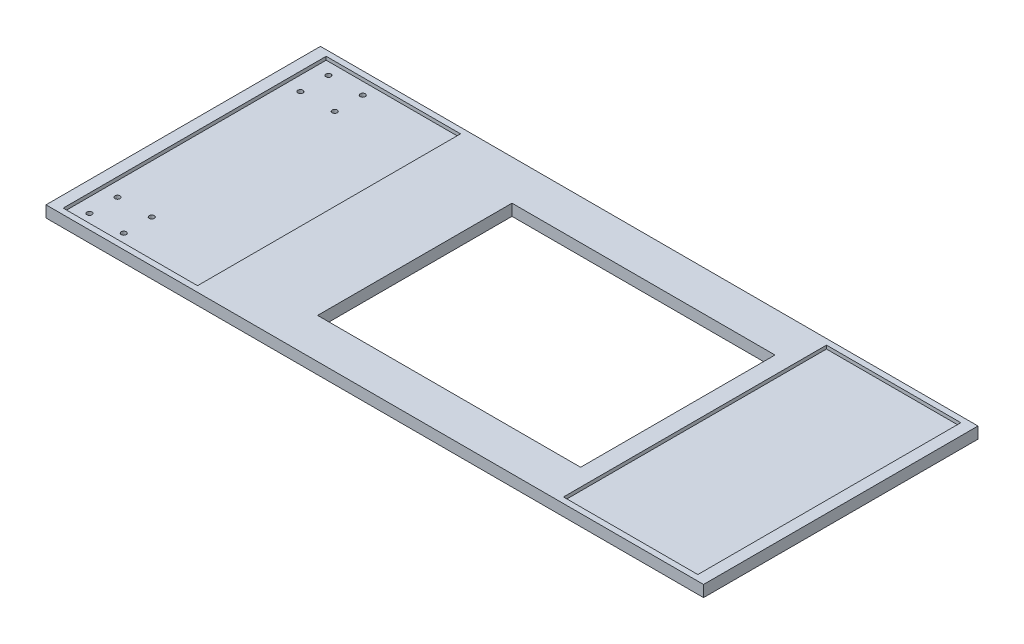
ISO-10303-21;
HEADER;
FILE_DESCRIPTION(('STEP AP214'),'2;1');
FILE_NAME('part.step','',(''),(''),'','','');
FILE_SCHEMA(('AUTOMOTIVE_DESIGN { 1 0 10303 214 1 1 1 1 }'));
ENDSEC;
DATA;
#1=APPLICATION_CONTEXT('core data for automotive mechanical design processes');
#2=APPLICATION_PROTOCOL_DEFINITION('international standard','automotive_design',2000,#1);
#3=PRODUCT_CONTEXT('',#1,'mechanical');
#4=PRODUCT('Part','Part','',(#3));
#5=PRODUCT_RELATED_PRODUCT_CATEGORY('part','',(#4));
#6=PRODUCT_DEFINITION_FORMATION('','',#4);
#7=PRODUCT_DEFINITION_CONTEXT('part definition',#1,'design');
#8=PRODUCT_DEFINITION('design','',#6,#7);
#9=PRODUCT_DEFINITION_SHAPE('','',#8);
#10=(LENGTH_UNIT() NAMED_UNIT(*) SI_UNIT(.MILLI.,.METRE.));
#11=(NAMED_UNIT(*) PLANE_ANGLE_UNIT() SI_UNIT($,.RADIAN.));
#12=(NAMED_UNIT(*) SI_UNIT($,.STERADIAN.) SOLID_ANGLE_UNIT());
#13=UNCERTAINTY_MEASURE_WITH_UNIT(LENGTH_MEASURE(1.E-05),#10,'distance_accuracy_value','');
#14=(GEOMETRIC_REPRESENTATION_CONTEXT(3) GLOBAL_UNCERTAINTY_ASSIGNED_CONTEXT((#13)) GLOBAL_UNIT_ASSIGNED_CONTEXT((#10,
#11,#12)) REPRESENTATION_CONTEXT('',''));
#15=CARTESIAN_POINT('',(0.,0.,0.));
#16=DIRECTION('',(0.,0.,1.));
#17=DIRECTION('',(1.,0.,0.));
#18=AXIS2_PLACEMENT_3D('',#15,#16,#17);
#19=CARTESIAN_POINT('',(-287.5,31.5,-120.));
#20=DIRECTION('',(1.,0.,0.));
#21=DIRECTION('',(0.,0.,-1.));
#22=AXIS2_PLACEMENT_3D('',#19,#20,#21);
#23=PLANE('',#22);
#24=DIRECTION('',(0.,0.,1.));
#25=VECTOR('',#24,1.);
#26=CARTESIAN_POINT('',(-287.5,0.,-120.));
#27=LINE('',#26,#25);
#28=CARTESIAN_POINT('',(-287.5,0.,-120.));
#29=VERTEX_POINT('',#28);
#30=CARTESIAN_POINT('',(-287.5,0.,120.));
#31=VERTEX_POINT('',#30);
#32=EDGE_CURVE('E186',#29,#31,#27,.T.);
#33=ORIENTED_EDGE('',*,*,#32,.T.);
#34=DIRECTION('',(0.,-1.,0.));
#35=VECTOR('',#34,1.);
#36=CARTESIAN_POINT('',(-287.5,31.5,120.));
#37=LINE('',#36,#35);
#38=CARTESIAN_POINT('',(-287.5,10.,120.));
#39=VERTEX_POINT('',#38);
#40=EDGE_CURVE('E12',#39,#31,#37,.T.);
#41=ORIENTED_EDGE('',*,*,#40,.F.);
#42=DIRECTION('',(0.,0.,-1.));
#43=VECTOR('',#42,1.);
#44=CARTESIAN_POINT('',(-287.5,10.,-120.));
#45=LINE('',#44,#43);
#46=CARTESIAN_POINT('',(-287.5,10.,-120.));
#47=VERTEX_POINT('',#46);
#48=EDGE_CURVE('E148',#39,#47,#45,.T.);
#49=ORIENTED_EDGE('',*,*,#48,.T.);
#50=DIRECTION('',(0.,-1.,0.));
#51=VECTOR('',#50,1.);
#52=CARTESIAN_POINT('',(-287.5,31.5,-120.));
#53=LINE('',#52,#51);
#54=EDGE_CURVE('E151',#47,#29,#53,.T.);
#55=ORIENTED_EDGE('',*,*,#54,.T.);
#56=EDGE_LOOP('',(#33,#41,#49,#55));
#57=FACE_BOUND('',#56,.T.);
#58=ADVANCED_FACE('F37',(#57),#23,.F.);
#59=CARTESIAN_POINT('',(287.5,31.5,120.));
#60=DIRECTION('',(0.,0.,-1.));
#61=DIRECTION('',(-1.,0.,0.));
#62=AXIS2_PLACEMENT_3D('',#59,#60,#61);
#63=PLANE('',#62);
#64=DIRECTION('',(0.,-1.,0.));
#65=VECTOR('',#64,1.);
#66=CARTESIAN_POINT('',(287.5,31.5,120.));
#67=LINE('',#66,#65);
#68=CARTESIAN_POINT('',(287.5,10.,120.));
#69=VERTEX_POINT('',#68);
#70=CARTESIAN_POINT('',(287.5,0.,120.));
#71=VERTEX_POINT('',#70);
#72=EDGE_CURVE('E44',#69,#71,#67,.T.);
#73=ORIENTED_EDGE('',*,*,#72,.F.);
#74=DIRECTION('',(-1.,0.,0.));
#75=VECTOR('',#74,1.);
#76=CARTESIAN_POINT('',(287.5,10.,120.));
#77=LINE('',#76,#75);
#78=EDGE_CURVE('E342',#69,#39,#77,.T.);
#79=ORIENTED_EDGE('',*,*,#78,.T.);
#80=ORIENTED_EDGE('',*,*,#40,.T.);
#81=DIRECTION('',(1.,0.,0.));
#82=VECTOR('',#81,1.);
#83=CARTESIAN_POINT('',(287.5,0.,120.));
#84=LINE('',#83,#82);
#85=EDGE_CURVE('E183',#31,#71,#84,.T.);
#86=ORIENTED_EDGE('',*,*,#85,.T.);
#87=EDGE_LOOP('',(#73,#79,#80,#86));
#88=FACE_BOUND('',#87,.T.);
#89=ADVANCED_FACE('F184',(#88),#63,.F.);
#90=CARTESIAN_POINT('',(287.5,31.5,-120.));
#91=DIRECTION('',(-1.,0.,0.));
#92=DIRECTION('',(0.,0.,1.));
#93=AXIS2_PLACEMENT_3D('',#90,#91,#92);
#94=PLANE('',#93);
#95=DIRECTION('',(0.,-1.,0.));
#96=VECTOR('',#95,1.);
#97=CARTESIAN_POINT('',(287.5,31.5,-120.));
#98=LINE('',#97,#96);
#99=CARTESIAN_POINT('',(287.5,10.,-120.));
#100=VERTEX_POINT('',#99);
#101=CARTESIAN_POINT('',(287.5,0.,-120.));
#102=VERTEX_POINT('',#101);
#103=EDGE_CURVE('E169',#100,#102,#98,.T.);
#104=ORIENTED_EDGE('',*,*,#103,.F.);
#105=DIRECTION('',(0.,0.,1.));
#106=VECTOR('',#105,1.);
#107=CARTESIAN_POINT('',(287.5,10.,-120.));
#108=LINE('',#107,#106);
#109=EDGE_CURVE('E161',#100,#69,#108,.T.);
#110=ORIENTED_EDGE('',*,*,#109,.T.);
#111=ORIENTED_EDGE('',*,*,#72,.T.);
#112=DIRECTION('',(0.,0.,-1.));
#113=VECTOR('',#112,1.);
#114=CARTESIAN_POINT('',(287.5,0.,-120.));
#115=LINE('',#114,#113);
#116=EDGE_CURVE('E172',#71,#102,#115,.T.);
#117=ORIENTED_EDGE('',*,*,#116,.T.);
#118=EDGE_LOOP('',(#104,#110,#111,#117));
#119=FACE_BOUND('',#118,.T.);
#120=ADVANCED_FACE('F179',(#119),#94,.F.);
#121=CARTESIAN_POINT('',(287.5,31.5,-120.));
#122=DIRECTION('',(0.,0.,1.));
#123=DIRECTION('',(1.,0.,0.));
#124=AXIS2_PLACEMENT_3D('',#121,#122,#123);
#125=PLANE('',#124);
#126=ORIENTED_EDGE('',*,*,#54,.F.);
#127=DIRECTION('',(1.,0.,0.));
#128=VECTOR('',#127,1.);
#129=CARTESIAN_POINT('',(287.5,10.,-120.));
#130=LINE('',#129,#128);
#131=EDGE_CURVE('E155',#47,#100,#130,.T.);
#132=ORIENTED_EDGE('',*,*,#131,.T.);
#133=ORIENTED_EDGE('',*,*,#103,.T.);
#134=DIRECTION('',(-1.,0.,0.));
#135=VECTOR('',#134,1.);
#136=CARTESIAN_POINT('',(287.5,0.,-120.));
#137=LINE('',#136,#135);
#138=EDGE_CURVE('E167',#102,#29,#137,.T.);
#139=ORIENTED_EDGE('',*,*,#138,.T.);
#140=EDGE_LOOP('',(#126,#132,#133,#139));
#141=FACE_BOUND('',#140,.T.);
#142=ADVANCED_FACE('F165',(#141),#125,.F.);
#143=CARTESIAN_POINT('',(0.,0.,0.));
#144=DIRECTION('',(0.,-1.,0.));
#145=DIRECTION('',(0.,0.,-1.));
#146=AXIS2_PLACEMENT_3D('',#143,#144,#145);
#147=PLANE('',#146);
#148=ORIENTED_EDGE('',*,*,#85,.F.);
#149=ORIENTED_EDGE('',*,*,#32,.F.);
#150=ORIENTED_EDGE('',*,*,#138,.F.);
#151=ORIENTED_EDGE('',*,*,#116,.F.);
#152=EDGE_LOOP('',(#148,#149,#150,#151));
#153=FACE_BOUND('',#152,.T.);
#154=CARTESIAN_POINT('',(-235.,0.,-80.));
#155=DIRECTION('',(0.,-1.,0.));
#156=DIRECTION('',(0.,0.,-1.));
#157=AXIS2_PLACEMENT_3D('',#154,#155,#156);
#158=CIRCLE('',#157,2.19999999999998);
#159=CARTESIAN_POINT('',(-235.,0.,-82.2));
#160=VERTEX_POINT('',#159);
#161=EDGE_CURVE('E284',#160,#160,#158,.F.);
#162=ORIENTED_EDGE('',*,*,#161,.T.);
#163=EDGE_LOOP('',(#162));
#164=FACE_BOUND('',#163,.T.);
#165=CARTESIAN_POINT('',(-235.,0.,-104.5));
#166=DIRECTION('',(0.,-1.,0.));
#167=DIRECTION('',(0.,0.,-1.));
#168=AXIS2_PLACEMENT_3D('',#165,#166,#167);
#169=CIRCLE('',#168,2.19999999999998);
#170=CARTESIAN_POINT('',(-235.,0.,-106.7));
#171=VERTEX_POINT('',#170);
#172=EDGE_CURVE('E291',#171,#171,#169,.F.);
#173=ORIENTED_EDGE('',*,*,#172,.T.);
#174=EDGE_LOOP('',(#173));
#175=FACE_BOUND('',#174,.T.);
#176=CARTESIAN_POINT('',(-265.,0.,-104.5));
#177=DIRECTION('',(0.,-1.,0.));
#178=DIRECTION('',(0.,0.,-1.));
#179=AXIS2_PLACEMENT_3D('',#176,#177,#178);
#180=CIRCLE('',#179,2.19999999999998);
#181=CARTESIAN_POINT('',(-265.,0.,-106.7));
#182=VERTEX_POINT('',#181);
#183=EDGE_CURVE('E294',#182,#182,#180,.F.);
#184=ORIENTED_EDGE('',*,*,#183,.T.);
#185=EDGE_LOOP('',(#184));
#186=FACE_BOUND('',#185,.T.);
#187=CARTESIAN_POINT('',(-265.,0.,-80.));
#188=DIRECTION('',(0.,-1.,0.));
#189=DIRECTION('',(0.,0.,-1.));
#190=AXIS2_PLACEMENT_3D('',#187,#188,#189);
#191=CIRCLE('',#190,2.19999999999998);
#192=CARTESIAN_POINT('',(-265.,0.,-82.2));
#193=VERTEX_POINT('',#192);
#194=EDGE_CURVE('E297',#193,#193,#191,.F.);
#195=ORIENTED_EDGE('',*,*,#194,.T.);
#196=EDGE_LOOP('',(#195));
#197=FACE_BOUND('',#196,.T.);
#198=CARTESIAN_POINT('',(-235.,0.,80.));
#199=DIRECTION('',(0.,-1.,0.));
#200=DIRECTION('',(0.,0.,-1.));
#201=AXIS2_PLACEMENT_3D('',#198,#199,#200);
#202=CIRCLE('',#201,2.19999999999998);
#203=CARTESIAN_POINT('',(-235.,0.,77.8));
#204=VERTEX_POINT('',#203);
#205=EDGE_CURVE('E264',#204,#204,#202,.T.);
#206=ORIENTED_EDGE('',*,*,#205,.F.);
#207=EDGE_LOOP('',(#206));
#208=FACE_BOUND('',#207,.T.);
#209=CARTESIAN_POINT('',(-235.,0.,104.5));
#210=DIRECTION('',(0.,-1.,0.));
#211=DIRECTION('',(0.,0.,-1.));
#212=AXIS2_PLACEMENT_3D('',#209,#210,#211);
#213=CIRCLE('',#212,2.19999999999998);
#214=CARTESIAN_POINT('',(-235.,0.,102.3));
#215=VERTEX_POINT('',#214);
#216=EDGE_CURVE('E267',#215,#215,#213,.T.);
#217=ORIENTED_EDGE('',*,*,#216,.F.);
#218=EDGE_LOOP('',(#217));
#219=FACE_BOUND('',#218,.T.);
#220=CARTESIAN_POINT('',(-265.,0.,104.5));
#221=DIRECTION('',(0.,-1.,0.));
#222=DIRECTION('',(0.,0.,-1.));
#223=AXIS2_PLACEMENT_3D('',#220,#221,#222);
#224=CIRCLE('',#223,2.19999999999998);
#225=CARTESIAN_POINT('',(-265.,0.,102.3));
#226=VERTEX_POINT('',#225);
#227=EDGE_CURVE('E270',#226,#226,#224,.T.);
#228=ORIENTED_EDGE('',*,*,#227,.F.);
#229=EDGE_LOOP('',(#228));
#230=FACE_BOUND('',#229,.T.);
#231=CARTESIAN_POINT('',(-265.,0.,80.));
#232=DIRECTION('',(0.,-1.,0.));
#233=DIRECTION('',(0.,0.,-1.));
#234=AXIS2_PLACEMENT_3D('',#231,#232,#233);
#235=CIRCLE('',#234,2.19999999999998);
#236=CARTESIAN_POINT('',(-265.,0.,77.8));
#237=VERTEX_POINT('',#236);
#238=EDGE_CURVE('E273',#237,#237,#235,.T.);
#239=ORIENTED_EDGE('',*,*,#238,.F.);
#240=EDGE_LOOP('',(#239));
#241=FACE_BOUND('',#240,.T.);
#242=DIRECTION('',(0.,0.,1.));
#243=VECTOR('',#242,1.);
#244=CARTESIAN_POINT('',(-85.,0.,-85.));
#245=LINE('',#244,#243);
#246=CARTESIAN_POINT('',(-85.,0.,-85.));
#247=VERTEX_POINT('',#246);
#248=CARTESIAN_POINT('',(-85.,0.,85.));
#249=VERTEX_POINT('',#248);
#250=EDGE_CURVE('E261',#247,#249,#245,.T.);
#251=ORIENTED_EDGE('',*,*,#250,.T.);
#252=DIRECTION('',(1.,0.,0.));
#253=VECTOR('',#252,1.);
#254=CARTESIAN_POINT('',(145.,0.,85.));
#255=LINE('',#254,#253);
#256=CARTESIAN_POINT('',(145.,0.,85.));
#257=VERTEX_POINT('',#256);
#258=EDGE_CURVE('E258',#249,#257,#255,.T.);
#259=ORIENTED_EDGE('',*,*,#258,.T.);
#260=DIRECTION('',(0.,0.,-1.));
#261=VECTOR('',#260,1.);
#262=CARTESIAN_POINT('',(145.,0.,-85.));
#263=LINE('',#262,#261);
#264=CARTESIAN_POINT('',(145.,0.,-85.));
#265=VERTEX_POINT('',#264);
#266=EDGE_CURVE('E255',#257,#265,#263,.T.);
#267=ORIENTED_EDGE('',*,*,#266,.T.);
#268=DIRECTION('',(-1.,0.,0.));
#269=VECTOR('',#268,1.);
#270=CARTESIAN_POINT('',(145.,0.,-85.));
#271=LINE('',#270,#269);
#272=EDGE_CURVE('E245',#265,#247,#271,.T.);
#273=ORIENTED_EDGE('',*,*,#272,.T.);
#274=EDGE_LOOP('',(#251,#259,#267,#273));
#275=FACE_BOUND('',#274,.T.);
#276=ADVANCED_FACE('F188',(#153,#164,#175,#186,#197,#208,#219,#230,#241,#275),#147,.T.);
#277=CARTESIAN_POINT('',(-277.5,7.,-115.));
#278=DIRECTION('',(-1.,0.,0.));
#279=DIRECTION('',(0.,0.,1.));
#280=AXIS2_PLACEMENT_3D('',#277,#278,#279);
#281=PLANE('',#280);
#282=DIRECTION('',(0.,1.,0.));
#283=VECTOR('',#282,1.);
#284=CARTESIAN_POINT('',(-277.5,7.,-115.));
#285=LINE('',#284,#283);
#286=CARTESIAN_POINT('',(-277.5,7.,-115.));
#287=VERTEX_POINT('',#286);
#288=CARTESIAN_POINT('',(-277.5,10.,-115.));
#289=VERTEX_POINT('',#288);
#290=EDGE_CURVE('E192',#287,#289,#285,.T.);
#291=ORIENTED_EDGE('',*,*,#290,.T.);
#292=DIRECTION('',(0.,0.,1.));
#293=VECTOR('',#292,1.);
#294=CARTESIAN_POINT('',(-277.5,10.,-115.));
#295=LINE('',#294,#293);
#296=CARTESIAN_POINT('',(-277.5,10.,115.));
#297=VERTEX_POINT('',#296);
#298=EDGE_CURVE('E321',#289,#297,#295,.T.);
#299=ORIENTED_EDGE('',*,*,#298,.T.);
#300=DIRECTION('',(0.,1.,0.));
#301=VECTOR('',#300,1.);
#302=CARTESIAN_POINT('',(-277.5,7.,115.));
#303=LINE('',#302,#301);
#304=CARTESIAN_POINT('',(-277.5,7.,115.));
#305=VERTEX_POINT('',#304);
#306=EDGE_CURVE('E219',#305,#297,#303,.T.);
#307=ORIENTED_EDGE('',*,*,#306,.F.);
#308=DIRECTION('',(0.,0.,1.));
#309=VECTOR('',#308,1.);
#310=CARTESIAN_POINT('',(-277.5,7.,-115.));
#311=LINE('',#310,#309);
#312=EDGE_CURVE('E206',#287,#305,#311,.T.);
#313=ORIENTED_EDGE('',*,*,#312,.F.);
#314=EDGE_LOOP('',(#291,#299,#307,#313));
#315=FACE_BOUND('',#314,.T.);
#316=ADVANCED_FACE('F380',(#315),#281,.F.);
#317=CARTESIAN_POINT('',(-160.,7.,-115.));
#318=DIRECTION('',(0.,0.,-1.));
#319=DIRECTION('',(-1.,0.,0.));
#320=AXIS2_PLACEMENT_3D('',#317,#318,#319);
#321=PLANE('',#320);
#322=DIRECTION('',(0.,1.,0.));
#323=VECTOR('',#322,1.);
#324=CARTESIAN_POINT('',(-160.,7.,-115.));
#325=LINE('',#324,#323);
#326=CARTESIAN_POINT('',(-160.,7.,-115.));
#327=VERTEX_POINT('',#326);
#328=CARTESIAN_POINT('',(-160.,10.,-115.));
#329=VERTEX_POINT('',#328);
#330=EDGE_CURVE('E226',#327,#329,#325,.T.);
#331=ORIENTED_EDGE('',*,*,#330,.T.);
#332=DIRECTION('',(-1.,0.,0.));
#333=VECTOR('',#332,1.);
#334=CARTESIAN_POINT('',(-160.,10.,-115.));
#335=LINE('',#334,#333);
#336=EDGE_CURVE('E324',#329,#289,#335,.T.);
#337=ORIENTED_EDGE('',*,*,#336,.T.);
#338=ORIENTED_EDGE('',*,*,#290,.F.);
#339=DIRECTION('',(-1.,0.,0.));
#340=VECTOR('',#339,1.);
#341=CARTESIAN_POINT('',(-160.,7.,-115.));
#342=LINE('',#341,#340);
#343=EDGE_CURVE('E223',#327,#287,#342,.T.);
#344=ORIENTED_EDGE('',*,*,#343,.F.);
#345=EDGE_LOOP('',(#331,#337,#338,#344));
#346=FACE_BOUND('',#345,.T.);
#347=ADVANCED_FACE('F403',(#346),#321,.F.);
#348=CARTESIAN_POINT('',(-160.,7.,-115.));
#349=DIRECTION('',(1.,0.,0.));
#350=DIRECTION('',(0.,0.,-1.));
#351=AXIS2_PLACEMENT_3D('',#348,#349,#350);
#352=PLANE('',#351);
#353=DIRECTION('',(0.,1.,0.));
#354=VECTOR('',#353,1.);
#355=CARTESIAN_POINT('',(-160.,7.,115.));
#356=LINE('',#355,#354);
#357=CARTESIAN_POINT('',(-160.,7.,115.));
#358=VERTEX_POINT('',#357);
#359=CARTESIAN_POINT('',(-160.,10.,115.));
#360=VERTEX_POINT('',#359);
#361=EDGE_CURVE('E222',#358,#360,#356,.T.);
#362=ORIENTED_EDGE('',*,*,#361,.T.);
#363=DIRECTION('',(0.,0.,-1.));
#364=VECTOR('',#363,1.);
#365=CARTESIAN_POINT('',(-160.,10.,-115.));
#366=LINE('',#365,#364);
#367=EDGE_CURVE('E59',#360,#329,#366,.T.);
#368=ORIENTED_EDGE('',*,*,#367,.T.);
#369=ORIENTED_EDGE('',*,*,#330,.F.);
#370=DIRECTION('',(0.,0.,-1.));
#371=VECTOR('',#370,1.);
#372=CARTESIAN_POINT('',(-160.,7.,-115.));
#373=LINE('',#372,#371);
#374=EDGE_CURVE('E233',#358,#327,#373,.T.);
#375=ORIENTED_EDGE('',*,*,#374,.F.);
#376=EDGE_LOOP('',(#362,#368,#369,#375));
#377=FACE_BOUND('',#376,.T.);
#378=ADVANCED_FACE('F408',(#377),#352,.F.);
#379=CARTESIAN_POINT('',(-160.,7.,115.));
#380=DIRECTION('',(0.,0.,1.));
#381=DIRECTION('',(1.,0.,0.));
#382=AXIS2_PLACEMENT_3D('',#379,#380,#381);
#383=PLANE('',#382);
#384=ORIENTED_EDGE('',*,*,#306,.T.);
#385=DIRECTION('',(1.,0.,0.));
#386=VECTOR('',#385,1.);
#387=CARTESIAN_POINT('',(-160.,10.,115.));
#388=LINE('',#387,#386);
#389=EDGE_CURVE('E328',#297,#360,#388,.T.);
#390=ORIENTED_EDGE('',*,*,#389,.T.);
#391=ORIENTED_EDGE('',*,*,#361,.F.);
#392=DIRECTION('',(1.,0.,0.));
#393=VECTOR('',#392,1.);
#394=CARTESIAN_POINT('',(-160.,7.,115.));
#395=LINE('',#394,#393);
#396=EDGE_CURVE('E236',#305,#358,#395,.T.);
#397=ORIENTED_EDGE('',*,*,#396,.F.);
#398=EDGE_LOOP('',(#384,#390,#391,#397));
#399=FACE_BOUND('',#398,.T.);
#400=ADVANCED_FACE('F405',(#399),#383,.F.);
#401=CARTESIAN_POINT('',(0.,7.,0.));
#402=DIRECTION('',(0.,-1.,0.));
#403=DIRECTION('',(0.,0.,-1.));
#404=AXIS2_PLACEMENT_3D('',#401,#402,#403);
#405=PLANE('',#404);
#406=CARTESIAN_POINT('',(-235.,7.,-80.));
#407=DIRECTION('',(0.,-1.,0.));
#408=DIRECTION('',(0.,0.,1.));
#409=AXIS2_PLACEMENT_3D('',#406,#407,#408);
#410=CIRCLE('',#409,2.19999999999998);
#411=CARTESIAN_POINT('',(-235.,7.,-77.8));
#412=VERTEX_POINT('',#411);
#413=EDGE_CURVE('E304',#412,#412,#410,.T.);
#414=ORIENTED_EDGE('',*,*,#413,.T.);
#415=EDGE_LOOP('',(#414));
#416=FACE_BOUND('',#415,.T.);
#417=CARTESIAN_POINT('',(-235.,7.,-104.5));
#418=DIRECTION('',(0.,-1.,0.));
#419=DIRECTION('',(0.,0.,1.));
#420=AXIS2_PLACEMENT_3D('',#417,#418,#419);
#421=CIRCLE('',#420,2.19999999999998);
#422=CARTESIAN_POINT('',(-235.,7.,-102.3));
#423=VERTEX_POINT('',#422);
#424=EDGE_CURVE('E307',#423,#423,#421,.T.);
#425=ORIENTED_EDGE('',*,*,#424,.T.);
#426=EDGE_LOOP('',(#425));
#427=FACE_BOUND('',#426,.T.);
#428=CARTESIAN_POINT('',(-265.,7.,-104.5));
#429=DIRECTION('',(0.,-1.,0.));
#430=DIRECTION('',(0.,0.,-1.));
#431=AXIS2_PLACEMENT_3D('',#428,#429,#430);
#432=CIRCLE('',#431,2.19999999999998);
#433=CARTESIAN_POINT('',(-265.,7.,-106.7));
#434=VERTEX_POINT('',#433);
#435=EDGE_CURVE('E303',#434,#434,#432,.T.);
#436=ORIENTED_EDGE('',*,*,#435,.T.);
#437=EDGE_LOOP('',(#436));
#438=FACE_BOUND('',#437,.T.);
#439=CARTESIAN_POINT('',(-265.,7.,-80.));
#440=DIRECTION('',(0.,-1.,0.));
#441=DIRECTION('',(0.,0.,-1.));
#442=AXIS2_PLACEMENT_3D('',#439,#440,#441);
#443=CIRCLE('',#442,2.19999999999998);
#444=CARTESIAN_POINT('',(-265.,7.,-82.2));
#445=VERTEX_POINT('',#444);
#446=EDGE_CURVE('E300',#445,#445,#443,.T.);
#447=ORIENTED_EDGE('',*,*,#446,.T.);
#448=EDGE_LOOP('',(#447));
#449=FACE_BOUND('',#448,.T.);
#450=CARTESIAN_POINT('',(-235.,7.,80.));
#451=DIRECTION('',(0.,1.,0.));
#452=DIRECTION('',(0.,0.,-1.));
#453=AXIS2_PLACEMENT_3D('',#450,#451,#452);
#454=CIRCLE('',#453,2.19999999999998);
#455=CARTESIAN_POINT('',(-235.,7.,77.8));
#456=VERTEX_POINT('',#455);
#457=EDGE_CURVE('E280',#456,#456,#454,.T.);
#458=ORIENTED_EDGE('',*,*,#457,.F.);
#459=EDGE_LOOP('',(#458));
#460=FACE_BOUND('',#459,.T.);
#461=CARTESIAN_POINT('',(-235.,7.,104.5));
#462=DIRECTION('',(0.,1.,0.));
#463=DIRECTION('',(0.,0.,-1.));
#464=AXIS2_PLACEMENT_3D('',#461,#462,#463);
#465=CIRCLE('',#464,2.19999999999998);
#466=CARTESIAN_POINT('',(-235.,7.,102.3));
#467=VERTEX_POINT('',#466);
#468=EDGE_CURVE('E283',#467,#467,#465,.T.);
#469=ORIENTED_EDGE('',*,*,#468,.F.);
#470=EDGE_LOOP('',(#469));
#471=FACE_BOUND('',#470,.T.);
#472=CARTESIAN_POINT('',(-265.,7.,104.5));
#473=DIRECTION('',(0.,1.,0.));
#474=DIRECTION('',(0.,0.,1.));
#475=AXIS2_PLACEMENT_3D('',#472,#473,#474);
#476=CIRCLE('',#475,2.19999999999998);
#477=CARTESIAN_POINT('',(-265.,7.,106.7));
#478=VERTEX_POINT('',#477);
#479=EDGE_CURVE('E279',#478,#478,#476,.T.);
#480=ORIENTED_EDGE('',*,*,#479,.F.);
#481=EDGE_LOOP('',(#480));
#482=FACE_BOUND('',#481,.T.);
#483=CARTESIAN_POINT('',(-265.,7.,80.));
#484=DIRECTION('',(0.,1.,0.));
#485=DIRECTION('',(0.,0.,1.));
#486=AXIS2_PLACEMENT_3D('',#483,#484,#485);
#487=CIRCLE('',#486,2.19999999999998);
#488=CARTESIAN_POINT('',(-265.,7.,82.2));
#489=VERTEX_POINT('',#488);
#490=EDGE_CURVE('E276',#489,#489,#487,.T.);
#491=ORIENTED_EDGE('',*,*,#490,.F.);
#492=EDGE_LOOP('',(#491));
#493=FACE_BOUND('',#492,.T.);
#494=ORIENTED_EDGE('',*,*,#312,.T.);
#495=ORIENTED_EDGE('',*,*,#396,.T.);
#496=ORIENTED_EDGE('',*,*,#374,.T.);
#497=ORIENTED_EDGE('',*,*,#343,.T.);
#498=EDGE_LOOP('',(#494,#495,#496,#497));
#499=FACE_BOUND('',#498,.T.);
#500=ADVANCED_FACE('F364',(#416,#427,#438,#449,#460,#471,#482,#493,#499),#405,.F.);
#501=CARTESIAN_POINT('',(-85.,0.,-85.));
#502=DIRECTION('',(-1.,0.,0.));
#503=DIRECTION('',(0.,0.,1.));
#504=AXIS2_PLACEMENT_3D('',#501,#502,#503);
#505=PLANE('',#504);
#506=DIRECTION('',(0.,1.,0.));
#507=VECTOR('',#506,1.);
#508=CARTESIAN_POINT('',(-85.,0.,-85.));
#509=LINE('',#508,#507);
#510=CARTESIAN_POINT('',(-85.,10.,-85.));
#511=VERTEX_POINT('',#510);
#512=EDGE_CURVE('E218',#247,#511,#509,.T.);
#513=ORIENTED_EDGE('',*,*,#512,.T.);
#514=DIRECTION('',(0.,0.,1.));
#515=VECTOR('',#514,1.);
#516=CARTESIAN_POINT('',(-85.,10.,-85.));
#517=LINE('',#516,#515);
#518=CARTESIAN_POINT('',(-85.,10.,85.));
#519=VERTEX_POINT('',#518);
#520=EDGE_CURVE('E330',#511,#519,#517,.T.);
#521=ORIENTED_EDGE('',*,*,#520,.T.);
#522=DIRECTION('',(0.,1.,0.));
#523=VECTOR('',#522,1.);
#524=CARTESIAN_POINT('',(-85.,0.,85.));
#525=LINE('',#524,#523);
#526=EDGE_CURVE('E241',#249,#519,#525,.T.);
#527=ORIENTED_EDGE('',*,*,#526,.F.);
#528=ORIENTED_EDGE('',*,*,#250,.F.);
#529=EDGE_LOOP('',(#513,#521,#527,#528));
#530=FACE_BOUND('',#529,.T.);
#531=ADVANCED_FACE('F354',(#530),#505,.F.);
#532=CARTESIAN_POINT('',(145.,0.,-85.));
#533=DIRECTION('',(0.,0.,-1.));
#534=DIRECTION('',(-1.,0.,0.));
#535=AXIS2_PLACEMENT_3D('',#532,#533,#534);
#536=PLANE('',#535);
#537=DIRECTION('',(0.,1.,0.));
#538=VECTOR('',#537,1.);
#539=CARTESIAN_POINT('',(145.,0.,-85.));
#540=LINE('',#539,#538);
#541=CARTESIAN_POINT('',(145.,10.,-85.));
#542=VERTEX_POINT('',#541);
#543=EDGE_CURVE('E248',#265,#542,#540,.T.);
#544=ORIENTED_EDGE('',*,*,#543,.T.);
#545=DIRECTION('',(-1.,0.,0.));
#546=VECTOR('',#545,1.);
#547=CARTESIAN_POINT('',(145.,10.,-85.));
#548=LINE('',#547,#546);
#549=EDGE_CURVE('E333',#542,#511,#548,.T.);
#550=ORIENTED_EDGE('',*,*,#549,.T.);
#551=ORIENTED_EDGE('',*,*,#512,.F.);
#552=ORIENTED_EDGE('',*,*,#272,.F.);
#553=EDGE_LOOP('',(#544,#550,#551,#552));
#554=FACE_BOUND('',#553,.T.);
#555=ADVANCED_FACE('F356',(#554),#536,.F.);
#556=CARTESIAN_POINT('',(145.,0.,-85.));
#557=DIRECTION('',(1.,0.,0.));
#558=DIRECTION('',(0.,0.,-1.));
#559=AXIS2_PLACEMENT_3D('',#556,#557,#558);
#560=PLANE('',#559);
#561=DIRECTION('',(0.,1.,0.));
#562=VECTOR('',#561,1.);
#563=CARTESIAN_POINT('',(145.,0.,85.));
#564=LINE('',#563,#562);
#565=CARTESIAN_POINT('',(145.,10.,85.));
#566=VERTEX_POINT('',#565);
#567=EDGE_CURVE('E244',#257,#566,#564,.T.);
#568=ORIENTED_EDGE('',*,*,#567,.T.);
#569=DIRECTION('',(0.,0.,-1.));
#570=VECTOR('',#569,1.);
#571=CARTESIAN_POINT('',(145.,10.,-85.));
#572=LINE('',#571,#570);
#573=EDGE_CURVE('E336',#566,#542,#572,.T.);
#574=ORIENTED_EDGE('',*,*,#573,.T.);
#575=ORIENTED_EDGE('',*,*,#543,.F.);
#576=ORIENTED_EDGE('',*,*,#266,.F.);
#577=EDGE_LOOP('',(#568,#574,#575,#576));
#578=FACE_BOUND('',#577,.T.);
#579=ADVANCED_FACE('F349',(#578),#560,.F.);
#580=CARTESIAN_POINT('',(145.,0.,85.));
#581=DIRECTION('',(0.,0.,1.));
#582=DIRECTION('',(1.,0.,0.));
#583=AXIS2_PLACEMENT_3D('',#580,#581,#582);
#584=PLANE('',#583);
#585=ORIENTED_EDGE('',*,*,#526,.T.);
#586=DIRECTION('',(1.,0.,0.));
#587=VECTOR('',#586,1.);
#588=CARTESIAN_POINT('',(145.,10.,85.));
#589=LINE('',#588,#587);
#590=EDGE_CURVE('E339',#519,#566,#589,.T.);
#591=ORIENTED_EDGE('',*,*,#590,.T.);
#592=ORIENTED_EDGE('',*,*,#567,.F.);
#593=ORIENTED_EDGE('',*,*,#258,.F.);
#594=EDGE_LOOP('',(#585,#591,#592,#593));
#595=FACE_BOUND('',#594,.T.);
#596=ADVANCED_FACE('F346',(#595),#584,.F.);
#597=CARTESIAN_POINT('',(-265.,-3.,80.));
#598=DIRECTION('',(0.,1.,0.));
#599=DIRECTION('',(0.,0.,1.));
#600=AXIS2_PLACEMENT_3D('',#597,#598,#599);
#601=CYLINDRICAL_SURFACE('',#600,2.19999999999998);
#602=ORIENTED_EDGE('',*,*,#238,.T.);
#603=EDGE_LOOP('',(#602));
#604=FACE_BOUND('',#603,.T.);
#605=ORIENTED_EDGE('',*,*,#490,.T.);
#606=EDGE_LOOP('',(#605));
#607=FACE_BOUND('',#606,.T.);
#608=ADVANCED_FACE('F420',(#604,#607),#601,.F.);
#609=CARTESIAN_POINT('',(-265.,-3.,104.5));
#610=DIRECTION('',(0.,1.,0.));
#611=DIRECTION('',(0.,0.,1.));
#612=AXIS2_PLACEMENT_3D('',#609,#610,#611);
#613=CYLINDRICAL_SURFACE('',#612,2.19999999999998);
#614=ORIENTED_EDGE('',*,*,#227,.T.);
#615=EDGE_LOOP('',(#614));
#616=FACE_BOUND('',#615,.T.);
#617=ORIENTED_EDGE('',*,*,#479,.T.);
#618=EDGE_LOOP('',(#617));
#619=FACE_BOUND('',#618,.T.);
#620=ADVANCED_FACE('F424',(#616,#619),#613,.F.);
#621=CARTESIAN_POINT('',(-235.,-3.,104.5));
#622=DIRECTION('',(0.,1.,0.));
#623=DIRECTION('',(0.,0.,1.));
#624=AXIS2_PLACEMENT_3D('',#621,#622,#623);
#625=CYLINDRICAL_SURFACE('',#624,2.19999999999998);
#626=ORIENTED_EDGE('',*,*,#216,.T.);
#627=EDGE_LOOP('',(#626));
#628=FACE_BOUND('',#627,.T.);
#629=ORIENTED_EDGE('',*,*,#468,.T.);
#630=EDGE_LOOP('',(#629));
#631=FACE_BOUND('',#630,.T.);
#632=ADVANCED_FACE('F429',(#628,#631),#625,.F.);
#633=CARTESIAN_POINT('',(-235.,-3.,80.));
#634=DIRECTION('',(0.,1.,0.));
#635=DIRECTION('',(0.,0.,1.));
#636=AXIS2_PLACEMENT_3D('',#633,#634,#635);
#637=CYLINDRICAL_SURFACE('',#636,2.19999999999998);
#638=ORIENTED_EDGE('',*,*,#205,.T.);
#639=EDGE_LOOP('',(#638));
#640=FACE_BOUND('',#639,.T.);
#641=ORIENTED_EDGE('',*,*,#457,.T.);
#642=EDGE_LOOP('',(#641));
#643=FACE_BOUND('',#642,.T.);
#644=ADVANCED_FACE('F434',(#640,#643),#637,.F.);
#645=CARTESIAN_POINT('',(-265.,-3.,-80.));
#646=DIRECTION('',(0.,1.,0.));
#647=DIRECTION('',(0.,0.,1.));
#648=AXIS2_PLACEMENT_3D('',#645,#646,#647);
#649=CYLINDRICAL_SURFACE('',#648,2.19999999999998);
#650=ORIENTED_EDGE('',*,*,#194,.F.);
#651=EDGE_LOOP('',(#650));
#652=FACE_BOUND('',#651,.T.);
#653=ORIENTED_EDGE('',*,*,#446,.F.);
#654=EDGE_LOOP('',(#653));
#655=FACE_BOUND('',#654,.T.);
#656=ADVANCED_FACE('F437',(#652,#655),#649,.F.);
#657=CARTESIAN_POINT('',(-265.,-3.,-104.5));
#658=DIRECTION('',(0.,1.,0.));
#659=DIRECTION('',(0.,0.,1.));
#660=AXIS2_PLACEMENT_3D('',#657,#658,#659);
#661=CYLINDRICAL_SURFACE('',#660,2.19999999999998);
#662=ORIENTED_EDGE('',*,*,#183,.F.);
#663=EDGE_LOOP('',(#662));
#664=FACE_BOUND('',#663,.T.);
#665=ORIENTED_EDGE('',*,*,#435,.F.);
#666=EDGE_LOOP('',(#665));
#667=FACE_BOUND('',#666,.T.);
#668=ADVANCED_FACE('F444',(#664,#667),#661,.F.);
#669=CARTESIAN_POINT('',(-235.,-3.,-104.5));
#670=DIRECTION('',(0.,1.,0.));
#671=DIRECTION('',(0.,0.,1.));
#672=AXIS2_PLACEMENT_3D('',#669,#670,#671);
#673=CYLINDRICAL_SURFACE('',#672,2.19999999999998);
#674=ORIENTED_EDGE('',*,*,#172,.F.);
#675=EDGE_LOOP('',(#674));
#676=FACE_BOUND('',#675,.T.);
#677=ORIENTED_EDGE('',*,*,#424,.F.);
#678=EDGE_LOOP('',(#677));
#679=FACE_BOUND('',#678,.T.);
#680=ADVANCED_FACE('F449',(#676,#679),#673,.F.);
#681=CARTESIAN_POINT('',(-235.,-3.,-80.));
#682=DIRECTION('',(0.,1.,0.));
#683=DIRECTION('',(0.,0.,1.));
#684=AXIS2_PLACEMENT_3D('',#681,#682,#683);
#685=CYLINDRICAL_SURFACE('',#684,2.19999999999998);
#686=ORIENTED_EDGE('',*,*,#161,.F.);
#687=EDGE_LOOP('',(#686));
#688=FACE_BOUND('',#687,.T.);
#689=ORIENTED_EDGE('',*,*,#413,.F.);
#690=EDGE_LOOP('',(#689));
#691=FACE_BOUND('',#690,.T.);
#692=ADVANCED_FACE('F446',(#688,#691),#685,.F.);
#693=CARTESIAN_POINT('',(0.,10.,0.));
#694=DIRECTION('',(0.,-1.,0.));
#695=DIRECTION('',(0.,0.,-1.));
#696=AXIS2_PLACEMENT_3D('',#693,#694,#695);
#697=PLANE('',#696);
#698=ORIENTED_EDGE('',*,*,#131,.F.);
#699=ORIENTED_EDGE('',*,*,#48,.F.);
#700=ORIENTED_EDGE('',*,*,#78,.F.);
#701=ORIENTED_EDGE('',*,*,#109,.F.);
#702=EDGE_LOOP('',(#698,#699,#700,#701));
#703=FACE_BOUND('',#702,.T.);
#704=ORIENTED_EDGE('',*,*,#549,.F.);
#705=ORIENTED_EDGE('',*,*,#573,.F.);
#706=ORIENTED_EDGE('',*,*,#590,.F.);
#707=ORIENTED_EDGE('',*,*,#520,.F.);
#708=EDGE_LOOP('',(#704,#705,#706,#707));
#709=FACE_BOUND('',#708,.T.);
#710=ORIENTED_EDGE('',*,*,#336,.F.);
#711=ORIENTED_EDGE('',*,*,#367,.F.);
#712=ORIENTED_EDGE('',*,*,#389,.F.);
#713=ORIENTED_EDGE('',*,*,#298,.F.);
#714=EDGE_LOOP('',(#710,#711,#712,#713));
#715=FACE_BOUND('',#714,.T.);
#716=DIRECTION('',(-1.,0.,0.));
#717=VECTOR('',#716,1.);
#718=CARTESIAN_POINT('',(160.,10.,-115.));
#719=LINE('',#718,#717);
#720=CARTESIAN_POINT('',(277.5,10.,-115.));
#721=VERTEX_POINT('',#720);
#722=CARTESIAN_POINT('',(160.,10.,-115.));
#723=VERTEX_POINT('',#722);
#724=EDGE_CURVE('E315',#721,#723,#719,.T.);
#725=ORIENTED_EDGE('',*,*,#724,.F.);
#726=DIRECTION('',(0.,0.,-1.));
#727=VECTOR('',#726,1.);
#728=CARTESIAN_POINT('',(277.5,10.,-115.));
#729=LINE('',#728,#727);
#730=CARTESIAN_POINT('',(277.5,10.,115.));
#731=VERTEX_POINT('',#730);
#732=EDGE_CURVE('E51',#731,#721,#729,.T.);
#733=ORIENTED_EDGE('',*,*,#732,.F.);
#734=DIRECTION('',(1.,0.,0.));
#735=VECTOR('',#734,1.);
#736=CARTESIAN_POINT('',(160.,10.,115.));
#737=LINE('',#736,#735);
#738=CARTESIAN_POINT('',(160.,10.,115.));
#739=VERTEX_POINT('',#738);
#740=EDGE_CURVE('E319',#739,#731,#737,.T.);
#741=ORIENTED_EDGE('',*,*,#740,.F.);
#742=DIRECTION('',(0.,0.,1.));
#743=VECTOR('',#742,1.);
#744=CARTESIAN_POINT('',(160.,10.,-115.));
#745=LINE('',#744,#743);
#746=EDGE_CURVE('E308',#723,#739,#745,.T.);
#747=ORIENTED_EDGE('',*,*,#746,.F.);
#748=EDGE_LOOP('',(#725,#733,#741,#747));
#749=FACE_BOUND('',#748,.T.);
#750=ADVANCED_FACE('F158',(#703,#709,#715,#749),#697,.F.);
#751=CARTESIAN_POINT('',(0.,7.,0.));
#752=DIRECTION('',(0.,1.,0.));
#753=DIRECTION('',(0.,0.,1.));
#754=AXIS2_PLACEMENT_3D('',#751,#752,#753);
#755=PLANE('',#754);
#756=DIRECTION('',(0.,0.,1.));
#757=VECTOR('',#756,1.);
#758=CARTESIAN_POINT('',(160.,7.,-115.));
#759=LINE('',#758,#757);
#760=CARTESIAN_POINT('',(160.,7.,-115.));
#761=VERTEX_POINT('',#760);
#762=CARTESIAN_POINT('',(160.,7.,115.));
#763=VERTEX_POINT('',#762);
#764=EDGE_CURVE('E215',#761,#763,#759,.T.);
#765=ORIENTED_EDGE('',*,*,#764,.T.);
#766=DIRECTION('',(1.,0.,0.));
#767=VECTOR('',#766,1.);
#768=CARTESIAN_POINT('',(160.,7.,115.));
#769=LINE('',#768,#767);
#770=CARTESIAN_POINT('',(277.5,7.,115.));
#771=VERTEX_POINT('',#770);
#772=EDGE_CURVE('E212',#763,#771,#769,.T.);
#773=ORIENTED_EDGE('',*,*,#772,.T.);
#774=DIRECTION('',(0.,0.,-1.));
#775=VECTOR('',#774,1.);
#776=CARTESIAN_POINT('',(277.5,7.,-115.));
#777=LINE('',#776,#775);
#778=CARTESIAN_POINT('',(277.5,7.,-115.));
#779=VERTEX_POINT('',#778);
#780=EDGE_CURVE('E209',#771,#779,#777,.T.);
#781=ORIENTED_EDGE('',*,*,#780,.T.);
#782=DIRECTION('',(-1.,0.,0.));
#783=VECTOR('',#782,1.);
#784=CARTESIAN_POINT('',(160.,7.,-115.));
#785=LINE('',#784,#783);
#786=EDGE_CURVE('E197',#779,#761,#785,.T.);
#787=ORIENTED_EDGE('',*,*,#786,.T.);
#788=EDGE_LOOP('',(#765,#773,#781,#787));
#789=FACE_BOUND('',#788,.T.);
#790=ADVANCED_FACE('F390',(#789),#755,.T.);
#791=CARTESIAN_POINT('',(160.,7.,115.));
#792=DIRECTION('',(0.,0.,1.));
#793=DIRECTION('',(1.,0.,0.));
#794=AXIS2_PLACEMENT_3D('',#791,#792,#793);
#795=PLANE('',#794);
#796=DIRECTION('',(0.,1.,0.));
#797=VECTOR('',#796,1.);
#798=CARTESIAN_POINT('',(160.,7.,115.));
#799=LINE('',#798,#797);
#800=EDGE_CURVE('E193',#763,#739,#799,.T.);
#801=ORIENTED_EDGE('',*,*,#800,.T.);
#802=ORIENTED_EDGE('',*,*,#740,.T.);
#803=DIRECTION('',(0.,1.,0.));
#804=VECTOR('',#803,1.);
#805=CARTESIAN_POINT('',(277.5,7.,115.));
#806=LINE('',#805,#804);
#807=EDGE_CURVE('E196',#771,#731,#806,.T.);
#808=ORIENTED_EDGE('',*,*,#807,.F.);
#809=ORIENTED_EDGE('',*,*,#772,.F.);
#810=EDGE_LOOP('',(#801,#802,#808,#809));
#811=FACE_BOUND('',#810,.T.);
#812=ADVANCED_FACE('F386',(#811),#795,.F.);
#813=CARTESIAN_POINT('',(277.5,7.,-115.));
#814=DIRECTION('',(1.,0.,0.));
#815=DIRECTION('',(0.,0.,-1.));
#816=AXIS2_PLACEMENT_3D('',#813,#814,#815);
#817=PLANE('',#816);
#818=ORIENTED_EDGE('',*,*,#807,.T.);
#819=ORIENTED_EDGE('',*,*,#732,.T.);
#820=DIRECTION('',(0.,1.,0.));
#821=VECTOR('',#820,1.);
#822=CARTESIAN_POINT('',(277.5,7.,-115.));
#823=LINE('',#822,#821);
#824=EDGE_CURVE('E200',#779,#721,#823,.T.);
#825=ORIENTED_EDGE('',*,*,#824,.F.);
#826=ORIENTED_EDGE('',*,*,#780,.F.);
#827=EDGE_LOOP('',(#818,#819,#825,#826));
#828=FACE_BOUND('',#827,.T.);
#829=ADVANCED_FACE('F389',(#828),#817,.F.);
#830=CARTESIAN_POINT('',(160.,7.,-115.));
#831=DIRECTION('',(0.,0.,-1.));
#832=DIRECTION('',(-1.,0.,0.));
#833=AXIS2_PLACEMENT_3D('',#830,#831,#832);
#834=PLANE('',#833);
#835=ORIENTED_EDGE('',*,*,#824,.T.);
#836=ORIENTED_EDGE('',*,*,#724,.T.);
#837=DIRECTION('',(0.,1.,0.));
#838=VECTOR('',#837,1.);
#839=CARTESIAN_POINT('',(160.,7.,-115.));
#840=LINE('',#839,#838);
#841=EDGE_CURVE('E203',#761,#723,#840,.T.);
#842=ORIENTED_EDGE('',*,*,#841,.F.);
#843=ORIENTED_EDGE('',*,*,#786,.F.);
#844=EDGE_LOOP('',(#835,#836,#842,#843));
#845=FACE_BOUND('',#844,.T.);
#846=ADVANCED_FACE('F384',(#845),#834,.F.);
#847=CARTESIAN_POINT('',(160.,7.,-115.));
#848=DIRECTION('',(-1.,0.,0.));
#849=DIRECTION('',(0.,0.,1.));
#850=AXIS2_PLACEMENT_3D('',#847,#848,#849);
#851=PLANE('',#850);
#852=ORIENTED_EDGE('',*,*,#841,.T.);
#853=ORIENTED_EDGE('',*,*,#746,.T.);
#854=ORIENTED_EDGE('',*,*,#800,.F.);
#855=ORIENTED_EDGE('',*,*,#764,.F.);
#856=EDGE_LOOP('',(#852,#853,#854,#855));
#857=FACE_BOUND('',#856,.T.);
#858=ADVANCED_FACE('F381',(#857),#851,.F.);
#859=CLOSED_SHELL('',(#58,#89,#120,#142,#276,#316,#347,#378,#400,#500,#531,#555,#579,#596,#608,
#620,#632,#644,#656,#668,#680,#692,#750,#790,#812,#829,#846,#858));
#860=MANIFOLD_SOLID_BREP('B2',#859);
#861=ADVANCED_BREP_SHAPE_REPRESENTATION('',(#18,#860),#14);
#862=SHAPE_DEFINITION_REPRESENTATION(#9,#861);
ENDSEC;
END-ISO-10303-21;
